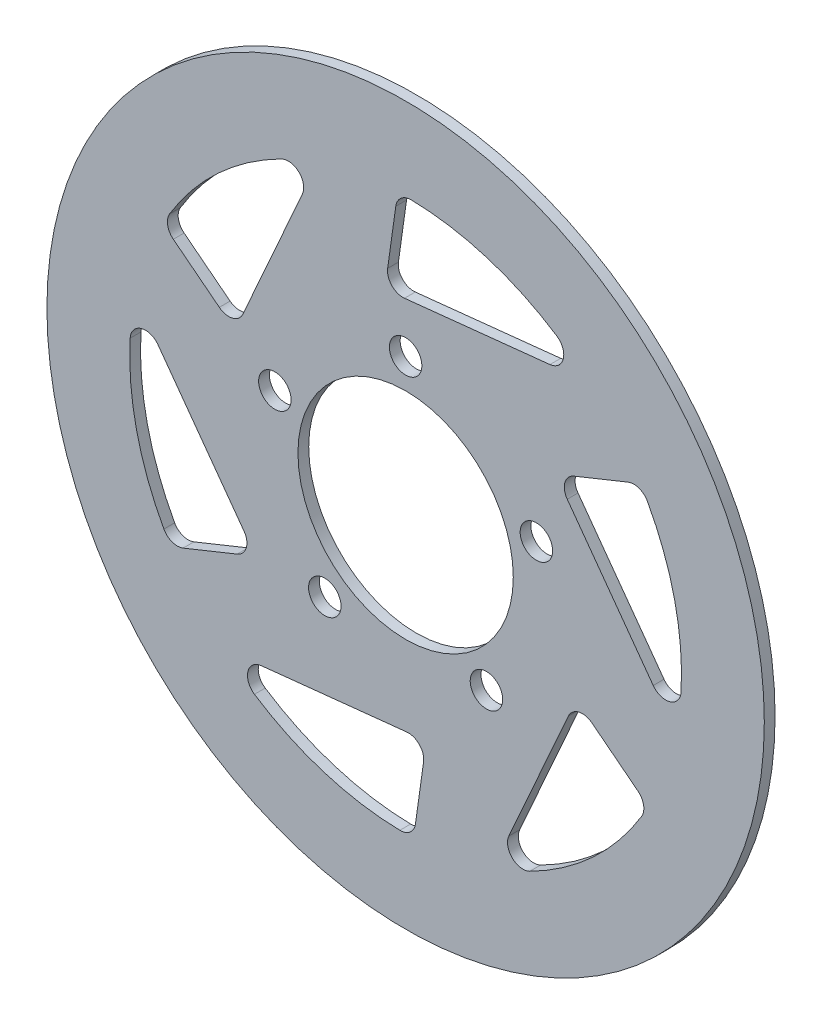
from build123d import *

# Parameters (mm, degrees)
SKETCH2_R           = 55
SKETCH2_R_2         = 16.51
BOSS_EXTRUDE1_DEPTH = 1.651
SKETCH3_R           = 2.4892
CUT_EXTRUDE2_DEPTH  = 78.79926607
CIRPATTERN1_COUNT   = 5
CUT_EXTRUDE3_DEPTH  = 78.79926607
CIRPATTERN2_COUNT   = 6


with BuildPart() as part:
    # Sketch2 → Boss-Extrude1 (new body)
    with BuildSketch(Plane.XY):
        with Locations(Location((0, 0, 0), (0, 0, 180))):
            Circle(SKETCH2_R)
        with Locations(Location((0, 0, 0), (0, 0, 180))):
            Circle(SKETCH2_R_2, mode=Mode.SUBTRACT)
    extrude(amount=BOSS_EXTRUDE1_DEPTH)

    # Sketch3 → Cut-Extrude2 (cut, through all)
    with BuildSketch(Plane.XY):
        with Locations(Location((0, 21.082, 0), (0, 0, 180))):
            Circle(SKETCH3_R)
    cut_extrude2 = extrude(amount=CUT_EXTRUDE2_DEPTH, mode=Mode.SUBTRACT)

    # CirPattern1: Cut-Extrude2 ×5 about axis
    cirpattern1_axis = Axis((0, 0, 0), (0, 0, 1))
    for i in range(1, CIRPATTERN1_COUNT):
        add(cut_extrude2.rotate(cirpattern1_axis, i * 360 / CIRPATTERN1_COUNT), mode=Mode.SUBTRACT)

    # Sketch4 → Cut-Extrude3 (cut, through all)
    with BuildSketch(Plane.XY):
        with BuildLine():
            Line((-2.754213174, 31.392117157), (-1.508207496, 40.257908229))
            ThreePointArc((-1.508207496, 40.257908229), (-0.700106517, 41.727955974), (0.880155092, 42.290842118))
            ThreePointArc((0.880155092, 42.290842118), (12.51612843, 40.405897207), (23.180150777, 35.383196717))
            ThreePointArc((23.180150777, 35.383196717), (24.181502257, 32.851214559), (22.132596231, 31.057998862))
            Line((22.132596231, 31.057998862), (-0.168084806, 28.714102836))
            ThreePointArc((-0.168084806, 28.714102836), (-2.114226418, 29.422440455), (-2.754213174, 31.392117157))
        make_face()
    cut_extrude3 = extrude(amount=CUT_EXTRUDE3_DEPTH, mode=Mode.SUBTRACT)

    # CirPattern2: Cut-Extrude3 ×6 about axis
    cirpattern2_axis = Axis((0, 0, 0), (0, 0, 1))
    for i in range(1, CIRPATTERN2_COUNT):
        add(cut_extrude3.rotate(cirpattern2_axis, i * 360 / CIRPATTERN2_COUNT), mode=Mode.SUBTRACT)


solid = part.part
